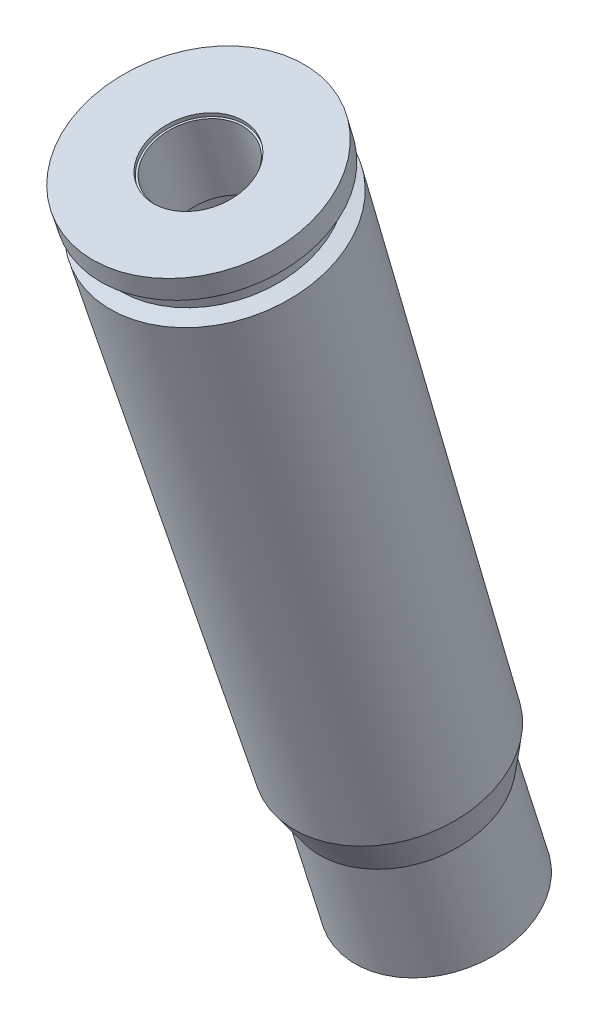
ISO-10303-21;
HEADER;
FILE_DESCRIPTION(('STEP AP214'),'2;1');
FILE_NAME('part.step','',(''),(''),'','','');
FILE_SCHEMA(('AUTOMOTIVE_DESIGN { 1 0 10303 214 1 1 1 1 }'));
ENDSEC;
DATA;
#1=APPLICATION_CONTEXT('core data for automotive mechanical design processes');
#2=APPLICATION_PROTOCOL_DEFINITION('international standard','automotive_design',2000,#1);
#3=PRODUCT_CONTEXT('',#1,'mechanical');
#4=PRODUCT('Part','Part','',(#3));
#5=PRODUCT_RELATED_PRODUCT_CATEGORY('part','',(#4));
#6=PRODUCT_DEFINITION_FORMATION('','',#4);
#7=PRODUCT_DEFINITION_CONTEXT('part definition',#1,'design');
#8=PRODUCT_DEFINITION('design','',#6,#7);
#9=PRODUCT_DEFINITION_SHAPE('','',#8);
#10=(LENGTH_UNIT() NAMED_UNIT(*) SI_UNIT(.MILLI.,.METRE.));
#11=(NAMED_UNIT(*) PLANE_ANGLE_UNIT() SI_UNIT($,.RADIAN.));
#12=(NAMED_UNIT(*) SI_UNIT($,.STERADIAN.) SOLID_ANGLE_UNIT());
#13=UNCERTAINTY_MEASURE_WITH_UNIT(LENGTH_MEASURE(1.E-05),#10,'distance_accuracy_value','');
#14=(GEOMETRIC_REPRESENTATION_CONTEXT(3) GLOBAL_UNCERTAINTY_ASSIGNED_CONTEXT((#13)) GLOBAL_UNIT_ASSIGNED_CONTEXT((#10,
#11,#12)) REPRESENTATION_CONTEXT('',''));
#15=CARTESIAN_POINT('',(0.,0.,0.));
#16=DIRECTION('',(0.,0.,1.));
#17=DIRECTION('',(1.,0.,0.));
#18=AXIS2_PLACEMENT_3D('',#15,#16,#17);
#19=CARTESIAN_POINT('',(-12.484424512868,44.9232313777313,44.6434586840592));
#20=DIRECTION('',(-0.0104502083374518,0.955233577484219,0.295668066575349));
#21=DIRECTION('',(0.,-0.295684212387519,0.955285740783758));
#22=AXIS2_PLACEMENT_3D('',#19,#20,#21);
#23=CYLINDRICAL_SURFACE('',#22,2.5);
#24=CARTESIAN_POINT('',(-12.5105500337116,47.3113153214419,45.3826288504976));
#25=DIRECTION('',(-0.0104502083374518,0.955233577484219,0.295668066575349));
#26=DIRECTION('',(0.,-0.295684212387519,0.955285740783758));
#27=AXIS2_PLACEMENT_3D('',#24,#25,#26);
#28=CIRCLE('',#27,2.5);
#29=CARTESIAN_POINT('',(-12.5105500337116,46.5721047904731,47.770843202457));
#30=VERTEX_POINT('',#29);
#31=EDGE_CURVE('E86',#30,#30,#28,.F.);
#32=ORIENTED_EDGE('',*,*,#31,.T.);
#33=EDGE_LOOP('',(#32));
#34=FACE_BOUND('',#33,.T.);
#35=CARTESIAN_POINT('',(-12.484424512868,44.9232313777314,44.6434586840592));
#36=DIRECTION('',(-0.0104502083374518,0.955233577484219,0.295668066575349));
#37=DIRECTION('',(0.,-0.295684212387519,0.955285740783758));
#38=AXIS2_PLACEMENT_3D('',#35,#36,#37);
#39=CIRCLE('',#38,2.5);
#40=CARTESIAN_POINT('',(-12.484424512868,44.1840208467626,47.0316730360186));
#41=VERTEX_POINT('',#40);
#42=EDGE_CURVE('E17',#41,#41,#39,.F.);
#43=ORIENTED_EDGE('',*,*,#42,.F.);
#44=EDGE_LOOP('',(#43));
#45=FACE_BOUND('',#44,.T.);
#46=ADVANCED_FACE('F14',(#34,#45),#23,.T.);
#47=CARTESIAN_POINT('',(-12.484424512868,44.9232313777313,44.6434586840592));
#48=DIRECTION('',(0.0104502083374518,-0.955233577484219,-0.295668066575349));
#49=DIRECTION('',(0.,0.295684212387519,-0.955285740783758));
#50=AXIS2_PLACEMENT_3D('',#47,#48,#49);
#51=PLANE('',#50);
#52=CARTESIAN_POINT('',(-12.4844245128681,44.9232313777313,44.6434586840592));
#53=DIRECTION('',(0.0104502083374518,-0.955233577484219,-0.295668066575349));
#54=DIRECTION('',(0.,0.295684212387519,-0.955285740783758));
#55=AXIS2_PLACEMENT_3D('',#52,#53,#54);
#56=CIRCLE('',#55,2.25);
#57=CARTESIAN_POINT('',(-12.4844245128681,45.5885208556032,42.4940657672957));
#58=VERTEX_POINT('',#57);
#59=EDGE_CURVE('E84',#58,#58,#56,.F.);
#60=ORIENTED_EDGE('',*,*,#59,.T.);
#61=EDGE_LOOP('',(#60));
#62=FACE_BOUND('',#61,.T.);
#63=ORIENTED_EDGE('',*,*,#42,.T.);
#64=EDGE_LOOP('',(#63));
#65=FACE_BOUND('',#64,.T.);
#66=ADVANCED_FACE('F93',(#62,#65),#51,.T.);
#67=CARTESIAN_POINT('',(-8.99565496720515,47.8658686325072,43.7152301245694));
#68=DIRECTION('',(-0.0104502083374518,0.955233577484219,0.295668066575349));
#69=DIRECTION('',(0.,-0.295684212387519,0.955285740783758));
#70=AXIS2_PLACEMENT_3D('',#67,#68,#69);
#71=PLANE('',#70);
#72=ORIENTED_EDGE('',*,*,#31,.F.);
#73=EDGE_LOOP('',(#72));
#74=FACE_BOUND('',#73,.T.);
#75=CARTESIAN_POINT('',(-12.5105500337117,47.3113153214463,45.382628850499));
#76=DIRECTION('',(0.0104502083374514,-0.955233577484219,-0.295668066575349));
#77=DIRECTION('',(0.,0.295684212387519,-0.955285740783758));
#78=AXIS2_PLACEMENT_3D('',#75,#76,#77);
#79=CIRCLE('',#78,3.92966095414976);
#80=CARTESIAN_POINT('',(-12.5105500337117,48.473254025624,41.628679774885));
#81=VERTEX_POINT('',#80);
#82=EDGE_CURVE('E81',#81,#81,#79,.T.);
#83=ORIENTED_EDGE('',*,*,#82,.T.);
#84=EDGE_LOOP('',(#83));
#85=FACE_BOUND('',#84,.T.);
#86=ADVANCED_FACE('F100',(#74,#85),#71,.F.);
#87=CARTESIAN_POINT('',(-12.5293604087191,49.0307357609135,45.9148313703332));
#88=DIRECTION('',(0.0104502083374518,-0.955233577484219,-0.295668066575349));
#89=DIRECTION('',(0.,0.295684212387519,-0.955285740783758));
#90=AXIS2_PLACEMENT_3D('',#87,#88,#89);
#91=CYLINDRICAL_SURFACE('',#90,2.25);
#92=CARTESIAN_POINT('',(-12.5272703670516,48.8396890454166,45.8556977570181));
#93=DIRECTION('',(0.0104502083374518,-0.955233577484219,-0.295668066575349));
#94=DIRECTION('',(0.,0.295684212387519,-0.955285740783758));
#95=AXIS2_PLACEMENT_3D('',#92,#93,#94);
#96=CIRCLE('',#95,2.25);
#97=CARTESIAN_POINT('',(-12.5272703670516,49.5049785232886,43.7063048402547));
#98=VERTEX_POINT('',#97);
#99=EDGE_CURVE('E59',#98,#98,#96,.T.);
#100=ORIENTED_EDGE('',*,*,#99,.F.);
#101=EDGE_LOOP('',(#100));
#102=FACE_BOUND('',#101,.T.);
#103=ORIENTED_EDGE('',*,*,#59,.F.);
#104=EDGE_LOOP('',(#103));
#105=FACE_BOUND('',#104,.T.);
#106=ADVANCED_FACE('F164',(#102,#105),#91,.F.);
#107=CARTESIAN_POINT('',(-12.4950245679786,45.8921621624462,44.9433663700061));
#108=DIRECTION('',(0.0104502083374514,-0.955233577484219,-0.295668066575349));
#109=DIRECTION('',(0.,0.295684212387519,-0.955285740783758));
#110=AXIS2_PLACEMENT_3D('',#107,#108,#109);
#111=CONICAL_SURFACE('',#110,4.28325681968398,0.233658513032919);
#112=CARTESIAN_POINT('',(-12.4950245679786,45.8921621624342,44.9433663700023));
#113=DIRECTION('',(0.0104502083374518,-0.955233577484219,-0.295668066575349));
#114=DIRECTION('',(-0.894452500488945,-0.14111988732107,0.424311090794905));
#115=AXIS2_PLACEMENT_3D('',#112,#113,#114);
#116=CIRCLE('',#115,4.28325681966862);
#117=CARTESIAN_POINT('',(-16.3261943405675,45.2877094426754,46.7607997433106));
#118=VERTEX_POINT('',#117);
#119=EDGE_CURVE('E56',#118,#118,#116,.T.);
#120=ORIENTED_EDGE('',*,*,#119,.T.);
#121=EDGE_LOOP('',(#120));
#122=FACE_BOUND('',#121,.T.);
#123=ORIENTED_EDGE('',*,*,#82,.F.);
#124=EDGE_LOOP('',(#123));
#125=FACE_BOUND('',#124,.T.);
#126=ADVANCED_FACE('F160',(#122,#125),#111,.F.);
#127=CARTESIAN_POINT('',(-12.5272703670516,48.8396890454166,45.8556977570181));
#128=DIRECTION('',(-0.0104502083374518,0.955233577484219,0.295668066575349));
#129=DIRECTION('',(0.,-0.295684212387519,0.955285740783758));
#130=AXIS2_PLACEMENT_3D('',#127,#128,#129);
#131=PLANE('',#130);
#132=ORIENTED_EDGE('',*,*,#99,.T.);
#133=EDGE_LOOP('',(#132));
#134=FACE_BOUND('',#133,.T.);
#135=CARTESIAN_POINT('',(-12.5272703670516,48.8396890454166,45.8556977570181));
#136=DIRECTION('',(-0.0104502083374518,0.955233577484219,0.295668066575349));
#137=DIRECTION('',(0.,-0.295684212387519,0.955285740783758));
#138=AXIS2_PLACEMENT_3D('',#135,#136,#137);
#139=CIRCLE('',#138,2.35);
#140=CARTESIAN_POINT('',(-12.5272703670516,48.1448311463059,48.1006192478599));
#141=VERTEX_POINT('',#140);
#142=EDGE_CURVE('E53',#141,#141,#139,.T.);
#143=ORIENTED_EDGE('',*,*,#142,.T.);
#144=EDGE_LOOP('',(#143));
#145=FACE_BOUND('',#144,.T.);
#146=ADVANCED_FACE('F156',(#134,#145),#131,.T.);
#147=CARTESIAN_POINT('',(-12.2037105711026,19.2637063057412,36.7012104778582));
#148=DIRECTION('',(0.0104502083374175,-0.955233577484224,-0.295668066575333));
#149=DIRECTION('',(0.,0.295684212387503,-0.955285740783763));
#150=AXIS2_PLACEMENT_3D('',#147,#148,#149);
#151=CONICAL_SURFACE('',#150,4.38056414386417,0.00349065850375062);
#152=CARTESIAN_POINT('',(-12.2037105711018,19.2637063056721,36.7012104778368));
#153=DIRECTION('',(-0.0104502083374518,0.955233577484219,0.295668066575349));
#154=DIRECTION('',(0.894452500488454,0.141119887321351,-0.424311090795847));
#155=AXIS2_PLACEMENT_3D('',#152,#153,#154);
#156=CIRCLE('',#155,4.38056414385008);
#157=CARTESIAN_POINT('',(-8.28550401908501,19.8818910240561,34.8424885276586));
#158=VERTEX_POINT('',#157);
#159=EDGE_CURVE('E50',#158,#158,#156,.F.);
#160=ORIENTED_EDGE('',*,*,#159,.T.);
#161=EDGE_LOOP('',(#160));
#162=FACE_BOUND('',#161,.T.);
#163=ORIENTED_EDGE('',*,*,#119,.F.);
#164=EDGE_LOOP('',(#163));
#165=FACE_BOUND('',#164,.T.);
#166=ADVANCED_FACE('F152',(#162,#165),#151,.F.);
#167=CARTESIAN_POINT('',(-12.5272703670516,48.8396890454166,45.8556977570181));
#168=DIRECTION('',(-0.0104502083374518,0.955233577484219,0.295668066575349));
#169=DIRECTION('',(0.,-0.295684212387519,0.955285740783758));
#170=AXIS2_PLACEMENT_3D('',#167,#168,#169);
#171=CYLINDRICAL_SURFACE('',#170,2.35);
#172=CARTESIAN_POINT('',(-12.5293604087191,49.0307357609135,45.9148313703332));
#173=DIRECTION('',(-0.0104502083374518,0.955233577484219,0.295668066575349));
#174=DIRECTION('',(0.,-0.295684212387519,0.955285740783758));
#175=AXIS2_PLACEMENT_3D('',#172,#173,#174);
#176=CIRCLE('',#175,2.35);
#177=CARTESIAN_POINT('',(-12.5293604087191,48.3358778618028,48.159752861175));
#178=VERTEX_POINT('',#177);
#179=EDGE_CURVE('E47',#178,#178,#176,.T.);
#180=ORIENTED_EDGE('',*,*,#179,.T.);
#181=EDGE_LOOP('',(#180));
#182=FACE_BOUND('',#181,.T.);
#183=ORIENTED_EDGE('',*,*,#142,.F.);
#184=EDGE_LOOP('',(#183));
#185=FACE_BOUND('',#184,.T.);
#186=ADVANCED_FACE('F148',(#182,#185),#171,.F.);
#187=CARTESIAN_POINT('',(-12.2037105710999,19.263706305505,36.7012104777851));
#188=DIRECTION('',(-0.0104502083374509,0.955233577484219,0.295668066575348));
#189=DIRECTION('',(0.,-0.295684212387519,0.955285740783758));
#190=AXIS2_PLACEMENT_3D('',#187,#188,#189);
#191=CONICAL_SURFACE('',#190,4.38056414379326,0.329272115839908);
#192=CARTESIAN_POINT('',(-12.1875045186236,17.7823420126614,36.2426921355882));
#193=DIRECTION('',(0.0104502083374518,-0.955233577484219,-0.295668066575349));
#194=DIRECTION('',(0.,0.295684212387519,-0.955285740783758));
#195=AXIS2_PLACEMENT_3D('',#192,#193,#194);
#196=CIRCLE('',#195,3.85064177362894);
#197=CARTESIAN_POINT('',(-12.1875045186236,18.9209159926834,32.5642289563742));
#198=VERTEX_POINT('',#197);
#199=EDGE_CURVE('E43',#198,#198,#196,.T.);
#200=ORIENTED_EDGE('',*,*,#199,.T.);
#201=EDGE_LOOP('',(#200));
#202=FACE_BOUND('',#201,.T.);
#203=ORIENTED_EDGE('',*,*,#159,.F.);
#204=EDGE_LOOP('',(#203));
#205=FACE_BOUND('',#204,.T.);
#206=ADVANCED_FACE('F144',(#202,#205),#191,.F.);
#207=CARTESIAN_POINT('',(-12.5293604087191,49.0307357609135,45.9148313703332));
#208=DIRECTION('',(0.0104502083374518,-0.955233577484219,-0.295668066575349));
#209=DIRECTION('',(0.,0.295684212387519,-0.955285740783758));
#210=AXIS2_PLACEMENT_3D('',#207,#208,#209);
#211=PLANE('',#210);
#212=ORIENTED_EDGE('',*,*,#179,.F.);
#213=EDGE_LOOP('',(#212));
#214=FACE_BOUND('',#213,.T.);
#215=CARTESIAN_POINT('',(-12.5293604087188,49.0307357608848,45.9148313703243));
#216=DIRECTION('',(-0.0104502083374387,0.955233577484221,0.295668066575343));
#217=DIRECTION('',(0.,-0.295684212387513,0.95528574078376));
#218=AXIS2_PLACEMENT_3D('',#215,#216,#217);
#219=CIRCLE('',#218,5.53471614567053);
#220=CARTESIAN_POINT('',(-12.5293604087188,47.3942075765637,51.202066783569));
#221=VERTEX_POINT('',#220);
#222=EDGE_CURVE('E46',#221,#221,#219,.F.);
#223=ORIENTED_EDGE('',*,*,#222,.F.);
#224=EDGE_LOOP('',(#223));
#225=FACE_BOUND('',#224,.T.);
#226=ADVANCED_FACE('F140',(#214,#225),#211,.F.);
#227=CARTESIAN_POINT('',(-12.5293604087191,49.0307357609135,45.9148313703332));
#228=DIRECTION('',(0.0104502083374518,-0.955233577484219,-0.295668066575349));
#229=DIRECTION('',(0.,0.295684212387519,-0.955285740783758));
#230=AXIS2_PLACEMENT_3D('',#227,#228,#229);
#231=CYLINDRICAL_SURFACE('',#230,3.85064177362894);
#232=CARTESIAN_POINT('',(-12.1217728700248,11.7739376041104,34.3829445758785));
#233=DIRECTION('',(0.0104502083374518,-0.955233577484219,-0.295668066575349));
#234=DIRECTION('',(0.,0.295684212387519,-0.955285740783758));
#235=AXIS2_PLACEMENT_3D('',#232,#233,#234);
#236=CIRCLE('',#235,3.85064177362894);
#237=CARTESIAN_POINT('',(-12.1217728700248,12.9125115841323,30.7044813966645));
#238=VERTEX_POINT('',#237);
#239=EDGE_CURVE('E70',#238,#238,#236,.T.);
#240=ORIENTED_EDGE('',*,*,#239,.T.);
#241=EDGE_LOOP('',(#240));
#242=FACE_BOUND('',#241,.T.);
#243=ORIENTED_EDGE('',*,*,#199,.F.);
#244=EDGE_LOOP('',(#243));
#245=FACE_BOUND('',#244,.T.);
#246=ADVANCED_FACE('F136',(#242,#245),#231,.F.);
#247=CARTESIAN_POINT('',(-12.5293604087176,49.030735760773,45.9148313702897));
#248=DIRECTION('',(-0.0104502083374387,0.955233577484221,0.295668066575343));
#249=DIRECTION('',(0.,-0.295684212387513,0.95528574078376));
#250=AXIS2_PLACEMENT_3D('',#247,#248,#249);
#251=CONICAL_SURFACE('',#250,5.53471614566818,0.0200783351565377);
#252=ORIENTED_EDGE('',*,*,#222,.T.);
#253=EDGE_LOOP('',(#252));
#254=FACE_BOUND('',#253,.T.);
#255=CARTESIAN_POINT('',(-12.5168201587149,47.8844554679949,45.5600296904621));
#256=DIRECTION('',(-0.0104502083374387,0.955233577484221,0.295668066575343));
#257=DIRECTION('',(0.,-0.295684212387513,0.95528574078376));
#258=AXIS2_PLACEMENT_3D('',#255,#256,#257);
#259=CIRCLE('',#258,5.51061890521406);
#260=CARTESIAN_POINT('',(-12.5168201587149,46.2550524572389,50.8242453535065));
#261=VERTEX_POINT('',#260);
#262=EDGE_CURVE('E67',#261,#261,#259,.T.);
#263=ORIENTED_EDGE('',*,*,#262,.T.);
#264=EDGE_LOOP('',(#263));
#265=FACE_BOUND('',#264,.T.);
#266=ADVANCED_FACE('F132',(#254,#265),#251,.T.);
#267=CARTESIAN_POINT('',(-8.34543541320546,12.3697392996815,32.5915226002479));
#268=DIRECTION('',(-0.0104502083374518,0.955233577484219,0.295668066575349));
#269=DIRECTION('',(0.,-0.295684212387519,0.955285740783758));
#270=AXIS2_PLACEMENT_3D('',#267,#268,#269);
#271=PLANE('',#270);
#272=ORIENTED_EDGE('',*,*,#239,.F.);
#273=EDGE_LOOP('',(#272));
#274=FACE_BOUND('',#273,.T.);
#275=CARTESIAN_POINT('',(-12.1217728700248,11.7739376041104,34.3829445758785));
#276=DIRECTION('',(0.0104502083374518,-0.955233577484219,-0.295668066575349));
#277=DIRECTION('',(0.,0.295684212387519,-0.955285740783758));
#278=AXIS2_PLACEMENT_3D('',#275,#276,#277);
#279=CIRCLE('',#278,4.22195416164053);
#280=CARTESIAN_POINT('',(-12.1217728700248,13.0223027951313,30.3497719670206));
#281=VERTEX_POINT('',#280);
#282=EDGE_CURVE('E64',#281,#281,#279,.F.);
#283=ORIENTED_EDGE('',*,*,#282,.F.);
#284=EDGE_LOOP('',(#283));
#285=FACE_BOUND('',#284,.T.);
#286=ADVANCED_FACE('F128',(#274,#285),#271,.F.);
#287=CARTESIAN_POINT('',(-7.58783329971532,48.6621133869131,43.2218129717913));
#288=DIRECTION('',(-0.0104502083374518,0.955233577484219,0.295668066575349));
#289=DIRECTION('',(0.,-0.295684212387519,0.955285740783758));
#290=AXIS2_PLACEMENT_3D('',#287,#288,#289);
#291=PLANE('',#290);
#292=CARTESIAN_POINT('',(-12.5168201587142,47.8844554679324,45.5600296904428));
#293=DIRECTION('',(0.0104502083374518,-0.955233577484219,-0.295668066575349));
#294=DIRECTION('',(0.,0.295684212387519,-0.955285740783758));
#295=AXIS2_PLACEMENT_3D('',#292,#293,#294);
#296=CIRCLE('',#295,4.8);
#297=CARTESIAN_POINT('',(-12.5168201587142,49.3037396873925,40.9746581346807));
#298=VERTEX_POINT('',#297);
#299=EDGE_CURVE('E40',#298,#298,#296,.T.);
#300=ORIENTED_EDGE('',*,*,#299,.F.);
#301=EDGE_LOOP('',(#300));
#302=FACE_BOUND('',#301,.T.);
#303=ORIENTED_EDGE('',*,*,#262,.F.);
#304=EDGE_LOOP('',(#303));
#305=FACE_BOUND('',#304,.T.);
#306=ADVANCED_FACE('F124',(#302,#305),#291,.F.);
#307=CARTESIAN_POINT('',(-12.5293604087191,49.0307357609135,45.9148313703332));
#308=DIRECTION('',(0.0104502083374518,-0.955233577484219,-0.295668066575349));
#309=DIRECTION('',(0.,0.295684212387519,-0.955285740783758));
#310=AXIS2_PLACEMENT_3D('',#307,#308,#309);
#311=CYLINDRICAL_SURFACE('',#310,4.22195416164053);
#312=CARTESIAN_POINT('',(-12.1827009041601,17.3432527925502,36.1067833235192));
#313=DIRECTION('',(-0.0104502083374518,0.955233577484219,0.295668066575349));
#314=DIRECTION('',(0.894452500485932,0.141119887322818,-0.424311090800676));
#315=AXIS2_PLACEMENT_3D('',#312,#313,#314);
#316=CIRCLE('',#315,4.22195416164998);
#317=CARTESIAN_POINT('',(-8.40636344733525,17.9390544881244,34.315361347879));
#318=VERTEX_POINT('',#317);
#319=EDGE_CURVE('E35',#318,#318,#316,.T.);
#320=ORIENTED_EDGE('',*,*,#319,.F.);
#321=EDGE_LOOP('',(#320));
#322=FACE_BOUND('',#321,.T.);
#323=ORIENTED_EDGE('',*,*,#282,.T.);
#324=EDGE_LOOP('',(#323));
#325=FACE_BOUND('',#324,.T.);
#326=ADVANCED_FACE('F120',(#322,#325),#311,.T.);
#327=CARTESIAN_POINT('',(-12.5293604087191,49.0307357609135,45.9148313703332));
#328=DIRECTION('',(0.0104502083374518,-0.955233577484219,-0.295668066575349));
#329=DIRECTION('',(0.,0.295684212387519,-0.955285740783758));
#330=AXIS2_PLACEMENT_3D('',#327,#328,#329);
#331=CYLINDRICAL_SURFACE('',#330,4.8);
#332=ORIENTED_EDGE('',*,*,#299,.T.);
#333=EDGE_LOOP('',(#332));
#334=FACE_BOUND('',#333,.T.);
#335=CARTESIAN_POINT('',(-12.5042799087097,46.7381751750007,45.2052280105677));
#336=DIRECTION('',(0.0104502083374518,-0.955233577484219,-0.295668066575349));
#337=DIRECTION('',(-0.894452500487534,-0.141119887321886,0.424311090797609));
#338=AXIS2_PLACEMENT_3D('',#335,#336,#337);
#339=CIRCLE('',#338,4.79999999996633);
#340=CARTESIAN_POINT('',(-16.7976519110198,46.0607997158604,47.2419212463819));
#341=VERTEX_POINT('',#340);
#342=EDGE_CURVE('E26',#341,#341,#339,.T.);
#343=ORIENTED_EDGE('',*,*,#342,.F.);
#344=EDGE_LOOP('',(#343));
#345=FACE_BOUND('',#344,.T.);
#346=ADVANCED_FACE('F116',(#334,#345),#331,.T.);
#347=CARTESIAN_POINT('',(-12.2037105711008,19.263706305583,36.7012104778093));
#348=DIRECTION('',(-0.010450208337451,0.955233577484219,0.295668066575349));
#349=DIRECTION('',(0.,-0.295684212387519,0.955285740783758));
#350=AXIS2_PLACEMENT_3D('',#347,#348,#349);
#351=CONICAL_SURFACE('',#350,4.90895011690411,0.32927211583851);
#352=CARTESIAN_POINT('',(-12.2037105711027,19.2637063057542,36.7012104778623));
#353=DIRECTION('',(-0.0104502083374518,0.955233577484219,0.295668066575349));
#354=DIRECTION('',(0.894452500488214,0.141119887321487,-0.424311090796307));
#355=AXIS2_PLACEMENT_3D('',#352,#353,#354);
#356=CIRCLE('',#355,4.90895011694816);
#357=CARTESIAN_POINT('',(-7.81288786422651,19.9564567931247,34.6182884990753));
#358=VERTEX_POINT('',#357);
#359=EDGE_CURVE('E21',#358,#358,#356,.T.);
#360=ORIENTED_EDGE('',*,*,#359,.F.);
#361=EDGE_LOOP('',(#360));
#362=FACE_BOUND('',#361,.T.);
#363=ORIENTED_EDGE('',*,*,#319,.T.);
#364=EDGE_LOOP('',(#363));
#365=FACE_BOUND('',#364,.T.);
#366=ADVANCED_FACE('F109',(#362,#365),#351,.T.);
#367=CARTESIAN_POINT('',(-12.5011448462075,46.4516051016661,45.1165275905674));
#368=DIRECTION('',(0.0104502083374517,-0.955233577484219,-0.295668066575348));
#369=DIRECTION('',(0.,0.295684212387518,-0.955285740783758));
#370=AXIS2_PLACEMENT_3D('',#367,#368,#369);
#371=CONICAL_SURFACE('',#370,5.48049735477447,1.15557417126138);
#372=ORIENTED_EDGE('',*,*,#342,.T.);
#373=EDGE_LOOP('',(#372));
#374=FACE_BOUND('',#373,.T.);
#375=CARTESIAN_POINT('',(-12.5011448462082,46.4516051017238,45.1165275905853));
#376=DIRECTION('',(-0.0104502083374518,0.955233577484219,0.295668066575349));
#377=DIRECTION('',(0.894452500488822,0.141119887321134,-0.424311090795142));
#378=AXIS2_PLACEMENT_3D('',#375,#376,#377);
#379=CIRCLE('',#378,5.48049735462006);
#380=CARTESIAN_POINT('',(-7.5991002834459,47.2250122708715,42.7910917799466));
#381=VERTEX_POINT('',#380);
#382=EDGE_CURVE('E10',#381,#381,#379,.F.);
#383=ORIENTED_EDGE('',*,*,#382,.F.);
#384=EDGE_LOOP('',(#383));
#385=FACE_BOUND('',#384,.T.);
#386=ADVANCED_FACE('F104',(#374,#385),#371,.T.);
#387=CARTESIAN_POINT('',(-12.5011448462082,46.4516051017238,45.1165275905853));
#388=DIRECTION('',(-0.0104502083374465,0.95523357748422,0.295668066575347));
#389=DIRECTION('',(0.,-0.295684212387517,0.955285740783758));
#390=AXIS2_PLACEMENT_3D('',#387,#388,#389);
#391=CONICAL_SURFACE('',#390,5.48049735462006,0.0200783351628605);
#392=ORIENTED_EDGE('',*,*,#382,.T.);
#393=EDGE_LOOP('',(#392));
#394=FACE_BOUND('',#393,.T.);
#395=ORIENTED_EDGE('',*,*,#359,.T.);
#396=EDGE_LOOP('',(#395));
#397=FACE_BOUND('',#396,.T.);
#398=ADVANCED_FACE('F102',(#394,#397),#391,.T.);
#399=CLOSED_SHELL('',(#46,#66,#86,#106,#126,#146,#166,#186,#206,#226,#246,#266,#286,#306,#326,
#346,#366,#386,#398));
#400=MANIFOLD_SOLID_BREP('B1',#399);
#401=ADVANCED_BREP_SHAPE_REPRESENTATION('',(#18,#400),#14);
#402=SHAPE_DEFINITION_REPRESENTATION(#9,#401);
ENDSEC;
END-ISO-10303-21;
